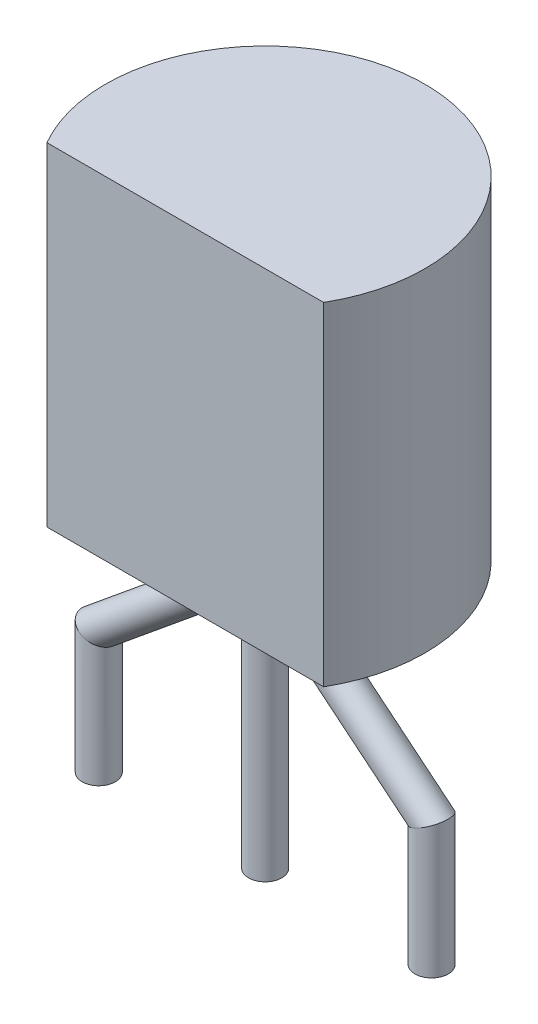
ISO-10303-21;
HEADER;
FILE_DESCRIPTION(('STEP AP214'),'2;1');
FILE_NAME('part.step','',(''),(''),'','','');
FILE_SCHEMA(('AUTOMOTIVE_DESIGN { 1 0 10303 214 1 1 1 1 }'));
ENDSEC;
DATA;
#1=APPLICATION_CONTEXT('core data for automotive mechanical design processes');
#2=APPLICATION_PROTOCOL_DEFINITION('international standard','automotive_design',2000,#1);
#3=PRODUCT_CONTEXT('',#1,'mechanical');
#4=PRODUCT('Part','Part','',(#3));
#5=PRODUCT_RELATED_PRODUCT_CATEGORY('part','',(#4));
#6=PRODUCT_DEFINITION_FORMATION('','',#4);
#7=PRODUCT_DEFINITION_CONTEXT('part definition',#1,'design');
#8=PRODUCT_DEFINITION('design','',#6,#7);
#9=PRODUCT_DEFINITION_SHAPE('','',#8);
#10=(LENGTH_UNIT() NAMED_UNIT(*) SI_UNIT(.MILLI.,.METRE.));
#11=(NAMED_UNIT(*) PLANE_ANGLE_UNIT() SI_UNIT($,.RADIAN.));
#12=(NAMED_UNIT(*) SI_UNIT($,.STERADIAN.) SOLID_ANGLE_UNIT());
#13=UNCERTAINTY_MEASURE_WITH_UNIT(LENGTH_MEASURE(1.E-05),#10,'distance_accuracy_value','');
#14=(GEOMETRIC_REPRESENTATION_CONTEXT(3) GLOBAL_UNCERTAINTY_ASSIGNED_CONTEXT((#13)) GLOBAL_UNIT_ASSIGNED_CONTEXT((#10,
#11,#12)) REPRESENTATION_CONTEXT('',''));
#15=CARTESIAN_POINT('',(0.,0.,0.));
#16=DIRECTION('',(0.,0.,1.));
#17=DIRECTION('',(1.,0.,0.));
#18=AXIS2_PLACEMENT_3D('',#15,#16,#17);
#19=CARTESIAN_POINT('',(0.,0.,0.));
#20=DIRECTION('',(0.,1.,0.));
#21=DIRECTION('',(0.,0.,1.));
#22=AXIS2_PLACEMENT_3D('',#19,#20,#21);
#23=PLANE('',#22);
#24=CARTESIAN_POINT('',(-1.,0.,0.));
#25=DIRECTION('',(0.,-1.,0.));
#26=DIRECTION('',(0.,0.,-1.));
#27=AXIS2_PLACEMENT_3D('',#24,#25,#26);
#28=CIRCLE('',#27,0.25);
#29=CARTESIAN_POINT('',(-1.,0.,-0.25));
#30=VERTEX_POINT('',#29);
#31=EDGE_CURVE('E40',#30,#30,#28,.T.);
#32=ORIENTED_EDGE('',*,*,#31,.F.);
#33=EDGE_LOOP('',(#32));
#34=FACE_BOUND('',#33,.T.);
#35=CARTESIAN_POINT('',(0.,0.,0.));
#36=DIRECTION('',(0.,1.,0.));
#37=DIRECTION('',(0.,0.,1.));
#38=AXIS2_PLACEMENT_3D('',#35,#36,#37);
#39=CIRCLE('',#38,2.4);
#40=CARTESIAN_POINT('',(2.07846096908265,0.,1.2));
#41=VERTEX_POINT('',#40);
#42=CARTESIAN_POINT('',(-2.07846096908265,0.,1.2));
#43=VERTEX_POINT('',#42);
#44=EDGE_CURVE('E62',#41,#43,#39,.T.);
#45=ORIENTED_EDGE('',*,*,#44,.F.);
#46=DIRECTION('',(1.,0.,0.));
#47=VECTOR('',#46,1.);
#48=CARTESIAN_POINT('',(-2.07846096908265,0.,1.2));
#49=LINE('',#48,#47);
#50=EDGE_CURVE('E59',#43,#41,#49,.T.);
#51=ORIENTED_EDGE('',*,*,#50,.F.);
#52=EDGE_LOOP('',(#45,#51));
#53=FACE_BOUND('',#52,.T.);
#54=CARTESIAN_POINT('',(0.,0.,0.));
#55=DIRECTION('',(0.,-1.,0.));
#56=DIRECTION('',(0.,0.,-1.));
#57=AXIS2_PLACEMENT_3D('',#54,#55,#56);
#58=CIRCLE('',#57,0.25);
#59=CARTESIAN_POINT('',(0.,0.,-0.25));
#60=VERTEX_POINT('',#59);
#61=EDGE_CURVE('E70',#60,#60,#58,.T.);
#62=ORIENTED_EDGE('',*,*,#61,.F.);
#63=EDGE_LOOP('',(#62));
#64=FACE_BOUND('',#63,.T.);
#65=CARTESIAN_POINT('',(1.,0.,0.));
#66=DIRECTION('',(0.,-1.,0.));
#67=DIRECTION('',(0.,0.,-1.));
#68=AXIS2_PLACEMENT_3D('',#65,#66,#67);
#69=CIRCLE('',#68,0.25);
#70=CARTESIAN_POINT('',(1.,0.,-0.25));
#71=VERTEX_POINT('',#70);
#72=EDGE_CURVE('E12',#71,#71,#69,.T.);
#73=ORIENTED_EDGE('',*,*,#72,.F.);
#74=EDGE_LOOP('',(#73));
#75=FACE_BOUND('',#74,.T.);
#76=ADVANCED_FACE('F31',(#34,#53,#64,#75),#23,.F.);
#77=CARTESIAN_POINT('',(0.,5.,0.));
#78=DIRECTION('',(0.,-1.,0.));
#79=DIRECTION('',(0.,0.,-1.));
#80=AXIS2_PLACEMENT_3D('',#77,#78,#79);
#81=CYLINDRICAL_SURFACE('',#80,2.4);
#82=ORIENTED_EDGE('',*,*,#44,.T.);
#83=DIRECTION('',(0.,-1.,0.));
#84=VECTOR('',#83,1.);
#85=CARTESIAN_POINT('',(-2.07846096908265,5.,1.2));
#86=LINE('',#85,#84);
#87=CARTESIAN_POINT('',(-2.07846096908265,5.,1.2));
#88=VERTEX_POINT('',#87);
#89=EDGE_CURVE('E35',#88,#43,#86,.T.);
#90=ORIENTED_EDGE('',*,*,#89,.F.);
#91=CARTESIAN_POINT('',(0.,5.,0.));
#92=DIRECTION('',(0.,1.,0.));
#93=DIRECTION('',(0.,0.,1.));
#94=AXIS2_PLACEMENT_3D('',#91,#92,#93);
#95=CIRCLE('',#94,2.4);
#96=CARTESIAN_POINT('',(2.07846096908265,5.,1.2));
#97=VERTEX_POINT('',#96);
#98=EDGE_CURVE('E64',#97,#88,#95,.T.);
#99=ORIENTED_EDGE('',*,*,#98,.F.);
#100=DIRECTION('',(0.,-1.,0.));
#101=VECTOR('',#100,1.);
#102=CARTESIAN_POINT('',(2.07846096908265,5.,1.2));
#103=LINE('',#102,#101);
#104=EDGE_CURVE('E71',#97,#41,#103,.T.);
#105=ORIENTED_EDGE('',*,*,#104,.T.);
#106=EDGE_LOOP('',(#82,#90,#99,#105));
#107=FACE_BOUND('',#106,.T.);
#108=ADVANCED_FACE('F33',(#107),#81,.T.);
#109=CARTESIAN_POINT('',(-2.07846096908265,5.,1.2));
#110=DIRECTION('',(0.,0.,-1.));
#111=DIRECTION('',(-1.,0.,0.));
#112=AXIS2_PLACEMENT_3D('',#109,#110,#111);
#113=PLANE('',#112);
#114=ORIENTED_EDGE('',*,*,#50,.T.);
#115=ORIENTED_EDGE('',*,*,#104,.F.);
#116=DIRECTION('',(1.,0.,0.));
#117=VECTOR('',#116,1.);
#118=CARTESIAN_POINT('',(-2.07846096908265,5.,1.2));
#119=LINE('',#118,#117);
#120=EDGE_CURVE('E47',#88,#97,#119,.T.);
#121=ORIENTED_EDGE('',*,*,#120,.F.);
#122=ORIENTED_EDGE('',*,*,#89,.T.);
#123=EDGE_LOOP('',(#114,#115,#121,#122));
#124=FACE_BOUND('',#123,.T.);
#125=ADVANCED_FACE('F67',(#124),#113,.F.);
#126=CARTESIAN_POINT('',(0.,5.,0.));
#127=DIRECTION('',(0.,1.,0.));
#128=DIRECTION('',(0.,0.,1.));
#129=AXIS2_PLACEMENT_3D('',#126,#127,#128);
#130=PLANE('',#129);
#131=ORIENTED_EDGE('',*,*,#98,.T.);
#132=ORIENTED_EDGE('',*,*,#120,.T.);
#133=EDGE_LOOP('',(#131,#132));
#134=FACE_BOUND('',#133,.T.);
#135=ADVANCED_FACE('F80',(#134),#130,.T.);
#136=CARTESIAN_POINT('',(0.,-4.,0.));
#137=DIRECTION('',(0.,1.,0.));
#138=DIRECTION('',(-1.,0.,0.));
#139=AXIS2_PLACEMENT_3D('',#136,#137,#138);
#140=CYLINDRICAL_SURFACE('',#139,0.25);
#141=CARTESIAN_POINT('',(0.,-4.,0.));
#142=DIRECTION('',(0.,-1.,0.));
#143=DIRECTION('',(0.,0.,-1.));
#144=AXIS2_PLACEMENT_3D('',#141,#142,#143);
#145=CIRCLE('',#144,0.25);
#146=CARTESIAN_POINT('',(0.,-4.,-0.25));
#147=VERTEX_POINT('',#146);
#148=EDGE_CURVE('E72',#147,#147,#145,.T.);
#149=ORIENTED_EDGE('',*,*,#148,.F.);
#150=EDGE_LOOP('',(#149));
#151=FACE_BOUND('',#150,.T.);
#152=ORIENTED_EDGE('',*,*,#61,.T.);
#153=EDGE_LOOP('',(#152));
#154=FACE_BOUND('',#153,.T.);
#155=ADVANCED_FACE('F82',(#151,#154),#140,.T.);
#156=CARTESIAN_POINT('',(0.,-4.,0.));
#157=DIRECTION('',(0.,-1.,0.));
#158=DIRECTION('',(0.,0.,-1.));
#159=AXIS2_PLACEMENT_3D('',#156,#157,#158);
#160=PLANE('',#159);
#161=ORIENTED_EDGE('',*,*,#148,.T.);
#162=EDGE_LOOP('',(#161));
#163=FACE_BOUND('',#162,.T.);
#164=ADVANCED_FACE('F88',(#163),#160,.T.);
#165=CARTESIAN_POINT('',(-2.5,-2.10246964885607,0.));
#166=DIRECTION('',(0.,-1.,0.));
#167=DIRECTION('',(1.,0.,0.));
#168=AXIS2_PLACEMENT_3D('',#165,#166,#167);
#169=CYLINDRICAL_SURFACE('',#168,0.25);
#170=CARTESIAN_POINT('',(-2.5,-2.10246964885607,0.));
#171=DIRECTION('',(-0.427478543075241,-0.904025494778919,0.));
#172=DIRECTION('',(-0.904025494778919,0.427478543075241,0.));
#173=AXIS2_PLACEMENT_3D('',#170,#171,#172);
#174=ELLIPSE('',#173,0.276540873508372,0.25);
#175=CARTESIAN_POINT('',(-2.75,-1.98425435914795,0.));
#176=VERTEX_POINT('',#175);
#177=EDGE_CURVE('E143',#176,#176,#174,.F.);
#178=ORIENTED_EDGE('',*,*,#177,.F.);
#179=EDGE_LOOP('',(#178));
#180=FACE_BOUND('',#179,.T.);
#181=CARTESIAN_POINT('',(-2.5,-4.,0.));
#182=DIRECTION('',(0.,-1.,0.));
#183=DIRECTION('',(1.,0.,0.));
#184=AXIS2_PLACEMENT_3D('',#181,#182,#183);
#185=CIRCLE('',#184,0.25);
#186=CARTESIAN_POINT('',(-2.25,-4.,0.));
#187=VERTEX_POINT('',#186);
#188=EDGE_CURVE('E75',#187,#187,#185,.T.);
#189=ORIENTED_EDGE('',*,*,#188,.F.);
#190=EDGE_LOOP('',(#189));
#191=FACE_BOUND('',#190,.T.);
#192=ADVANCED_FACE('F103',(#180,#191),#169,.T.);
#193=CARTESIAN_POINT('',(-1.,-0.871026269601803,0.));
#194=DIRECTION('',(-0.772903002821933,-0.634524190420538,0.));
#195=DIRECTION('',(0.634524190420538,-0.772903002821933,0.));
#196=AXIS2_PLACEMENT_3D('',#193,#194,#195);
#197=CYLINDRICAL_SURFACE('',#196,0.25);
#198=CARTESIAN_POINT('',(-1.,-0.871026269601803,0.));
#199=DIRECTION('',(-0.427478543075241,-0.904025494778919,0.));
#200=DIRECTION('',(-0.904025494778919,0.427478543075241,0.));
#201=AXIS2_PLACEMENT_3D('',#198,#199,#200);
#202=ELLIPSE('',#201,0.276540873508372,0.25);
#203=CARTESIAN_POINT('',(-1.25,-0.75281097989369,0.));
#204=VERTEX_POINT('',#203);
#205=EDGE_CURVE('E139',#204,#204,#202,.T.);
#206=ORIENTED_EDGE('',*,*,#205,.T.);
#207=EDGE_LOOP('',(#206));
#208=FACE_BOUND('',#207,.T.);
#209=ORIENTED_EDGE('',*,*,#177,.T.);
#210=EDGE_LOOP('',(#209));
#211=FACE_BOUND('',#210,.T.);
#212=ADVANCED_FACE('F107',(#208,#211),#197,.T.);
#213=CARTESIAN_POINT('',(-1.,-1.57813305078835,0.));
#214=DIRECTION('',(0.,1.,0.));
#215=DIRECTION('',(0.,0.,1.));
#216=AXIS2_PLACEMENT_3D('',#213,#214,#215);
#217=CYLINDRICAL_SURFACE('',#216,0.25);
#218=ORIENTED_EDGE('',*,*,#31,.T.);
#219=EDGE_LOOP('',(#218));
#220=FACE_BOUND('',#219,.T.);
#221=ORIENTED_EDGE('',*,*,#205,.F.);
#222=EDGE_LOOP('',(#221));
#223=FACE_BOUND('',#222,.T.);
#224=ADVANCED_FACE('F111',(#220,#223),#217,.T.);
#225=CARTESIAN_POINT('',(-2.5,-4.,0.));
#226=DIRECTION('',(0.,-1.,0.));
#227=DIRECTION('',(1.,0.,0.));
#228=AXIS2_PLACEMENT_3D('',#225,#226,#227);
#229=PLANE('',#228);
#230=ORIENTED_EDGE('',*,*,#188,.T.);
#231=EDGE_LOOP('',(#230));
#232=FACE_BOUND('',#231,.T.);
#233=ADVANCED_FACE('F115',(#232),#229,.T.);
#234=CARTESIAN_POINT('',(2.5,-2.10246964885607,0.));
#235=DIRECTION('',(0.,-1.,0.));
#236=DIRECTION('',(0.,0.,-1.));
#237=AXIS2_PLACEMENT_3D('',#234,#235,#236);
#238=CYLINDRICAL_SURFACE('',#237,0.25);
#239=CARTESIAN_POINT('',(2.5,-2.10246964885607,0.));
#240=DIRECTION('',(0.427478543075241,-0.904025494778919,0.));
#241=DIRECTION('',(0.904025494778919,0.427478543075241,0.));
#242=AXIS2_PLACEMENT_3D('',#239,#240,#241);
#243=ELLIPSE('',#242,0.276540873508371,0.25);
#244=CARTESIAN_POINT('',(2.75,-1.98425435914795,0.));
#245=VERTEX_POINT('',#244);
#246=EDGE_CURVE('E140',#245,#245,#243,.F.);
#247=ORIENTED_EDGE('',*,*,#246,.F.);
#248=EDGE_LOOP('',(#247));
#249=FACE_BOUND('',#248,.T.);
#250=CARTESIAN_POINT('',(2.5,-4.,0.));
#251=DIRECTION('',(0.,-1.,0.));
#252=DIRECTION('',(0.,0.,-1.));
#253=AXIS2_PLACEMENT_3D('',#250,#251,#252);
#254=CIRCLE('',#253,0.25);
#255=CARTESIAN_POINT('',(2.5,-4.,-0.25));
#256=VERTEX_POINT('',#255);
#257=EDGE_CURVE('E137',#256,#256,#254,.T.);
#258=ORIENTED_EDGE('',*,*,#257,.F.);
#259=EDGE_LOOP('',(#258));
#260=FACE_BOUND('',#259,.T.);
#261=ADVANCED_FACE('F118',(#249,#260),#238,.T.);
#262=CARTESIAN_POINT('',(1.,-0.871026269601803,0.));
#263=DIRECTION('',(0.772903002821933,-0.634524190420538,0.));
#264=DIRECTION('',(0.634524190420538,0.772903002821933,0.));
#265=AXIS2_PLACEMENT_3D('',#262,#263,#264);
#266=CYLINDRICAL_SURFACE('',#265,0.25);
#267=CARTESIAN_POINT('',(1.,-0.871026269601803,0.));
#268=DIRECTION('',(0.427478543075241,-0.904025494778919,0.));
#269=DIRECTION('',(0.904025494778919,0.427478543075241,0.));
#270=AXIS2_PLACEMENT_3D('',#267,#268,#269);
#271=ELLIPSE('',#270,0.276540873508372,0.25);
#272=CARTESIAN_POINT('',(1.25,-0.75281097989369,0.));
#273=VERTEX_POINT('',#272);
#274=EDGE_CURVE('E146',#273,#273,#271,.T.);
#275=ORIENTED_EDGE('',*,*,#274,.T.);
#276=EDGE_LOOP('',(#275));
#277=FACE_BOUND('',#276,.T.);
#278=ORIENTED_EDGE('',*,*,#246,.T.);
#279=EDGE_LOOP('',(#278));
#280=FACE_BOUND('',#279,.T.);
#281=ADVANCED_FACE('F121',(#277,#280),#266,.T.);
#282=CARTESIAN_POINT('',(1.,-1.57813305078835,0.));
#283=DIRECTION('',(0.,1.,0.));
#284=DIRECTION('',(0.,0.,1.));
#285=AXIS2_PLACEMENT_3D('',#282,#283,#284);
#286=CYLINDRICAL_SURFACE('',#285,0.25);
#287=ORIENTED_EDGE('',*,*,#72,.T.);
#288=EDGE_LOOP('',(#287));
#289=FACE_BOUND('',#288,.T.);
#290=ORIENTED_EDGE('',*,*,#274,.F.);
#291=EDGE_LOOP('',(#290));
#292=FACE_BOUND('',#291,.T.);
#293=ADVANCED_FACE('F125',(#289,#292),#286,.T.);
#294=CARTESIAN_POINT('',(2.5,-4.,0.));
#295=DIRECTION('',(0.,-1.,0.));
#296=DIRECTION('',(0.,0.,-1.));
#297=AXIS2_PLACEMENT_3D('',#294,#295,#296);
#298=PLANE('',#297);
#299=ORIENTED_EDGE('',*,*,#257,.T.);
#300=EDGE_LOOP('',(#299));
#301=FACE_BOUND('',#300,.T.);
#302=ADVANCED_FACE('F129',(#301),#298,.T.);
#303=CLOSED_SHELL('',(#76,#108,#125,#135,#155,#164,#192,#212,#224,#233,#261,#281,#293,#302));
#304=MANIFOLD_SOLID_BREP('B2',#303);
#305=ADVANCED_BREP_SHAPE_REPRESENTATION('',(#18,#304),#14);
#306=SHAPE_DEFINITION_REPRESENTATION(#9,#305);
ENDSEC;
END-ISO-10303-21;
